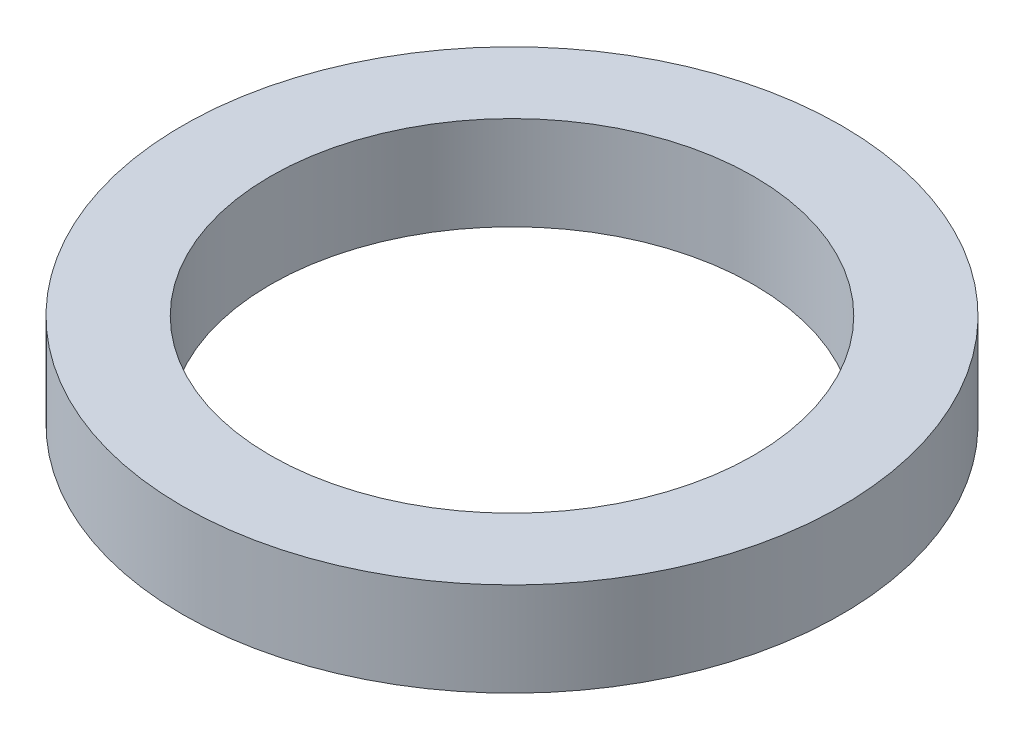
from build123d import *

# Parameters (mm, degrees)
SKETCH2_R           = 28.575
SKETCH2_R_2         = 20.955
BOSS_EXTRUDE1_DEPTH = 8.128


with BuildPart() as part:
    # Sketch2 → Boss-Extrude1 (new body)
    with BuildSketch(Plane(origin=(0, 0, 0), x_dir=(1, 0, 0), z_dir=(0, 1, 0))):
        with Locations(Location((0, 0, 0), (0, 0, 270))):
            Circle(SKETCH2_R)
        with Locations(Location((0, 0, 0), (0, 0, 270))):
            Circle(SKETCH2_R_2, mode=Mode.SUBTRACT)
    extrude(amount=BOSS_EXTRUDE1_DEPTH)


solid = part.part
